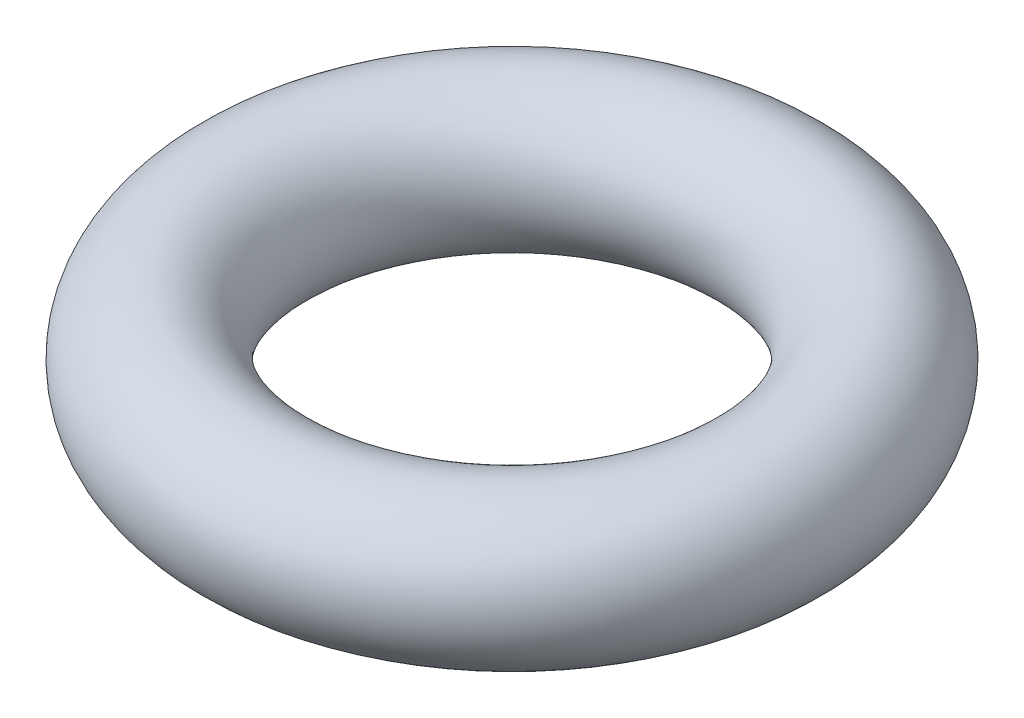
ISO-10303-21;
HEADER;
FILE_DESCRIPTION(('STEP AP214'),'2;1');
FILE_NAME('part.step','',(''),(''),'','','');
FILE_SCHEMA(('AUTOMOTIVE_DESIGN { 1 0 10303 214 1 1 1 1 }'));
ENDSEC;
DATA;
#1=APPLICATION_CONTEXT('core data for automotive mechanical design processes');
#2=APPLICATION_PROTOCOL_DEFINITION('international standard','automotive_design',2000,#1);
#3=PRODUCT_CONTEXT('',#1,'mechanical');
#4=PRODUCT('Part','Part','',(#3));
#5=PRODUCT_RELATED_PRODUCT_CATEGORY('part','',(#4));
#6=PRODUCT_DEFINITION_FORMATION('','',#4);
#7=PRODUCT_DEFINITION_CONTEXT('part definition',#1,'design');
#8=PRODUCT_DEFINITION('design','',#6,#7);
#9=PRODUCT_DEFINITION_SHAPE('','',#8);
#10=(LENGTH_UNIT() NAMED_UNIT(*) SI_UNIT(.MILLI.,.METRE.));
#11=(NAMED_UNIT(*) PLANE_ANGLE_UNIT() SI_UNIT($,.RADIAN.));
#12=(NAMED_UNIT(*) SI_UNIT($,.STERADIAN.) SOLID_ANGLE_UNIT());
#13=UNCERTAINTY_MEASURE_WITH_UNIT(LENGTH_MEASURE(1.E-05),#10,'distance_accuracy_value','');
#14=(GEOMETRIC_REPRESENTATION_CONTEXT(3) GLOBAL_UNCERTAINTY_ASSIGNED_CONTEXT((#13)) GLOBAL_UNIT_ASSIGNED_CONTEXT((#10,
#11,#12)) REPRESENTATION_CONTEXT('',''));
#15=CARTESIAN_POINT('',(0.,0.,0.));
#16=DIRECTION('',(0.,0.,1.));
#17=DIRECTION('',(1.,0.,0.));
#18=AXIS2_PLACEMENT_3D('',#15,#16,#17);
#19=CARTESIAN_POINT('',(0.,0.,0.));
#20=DIRECTION('',(0.,-1.,0.));
#21=DIRECTION('',(0.,0.,-1.));
#22=AXIS2_PLACEMENT_3D('',#19,#20,#21);
#23=TOROIDAL_SURFACE('',#22,3.1242,0.889);
#24=CARTESIAN_POINT('',(0.,0.,-4.0132));
#25=VERTEX_POINT('',#24);
#26=VERTEX_LOOP('',#25);
#27=FACE_BOUND('',#26,.T.);
#28=ADVANCED_FACE('F30',(#27),#23,.T.);
#29=CLOSED_SHELL('',(#28));
#30=MANIFOLD_SOLID_BREP('B2',#29);
#31=ADVANCED_BREP_SHAPE_REPRESENTATION('',(#18,#30),#14);
#32=SHAPE_DEFINITION_REPRESENTATION(#9,#31);
ENDSEC;
END-ISO-10303-21;
